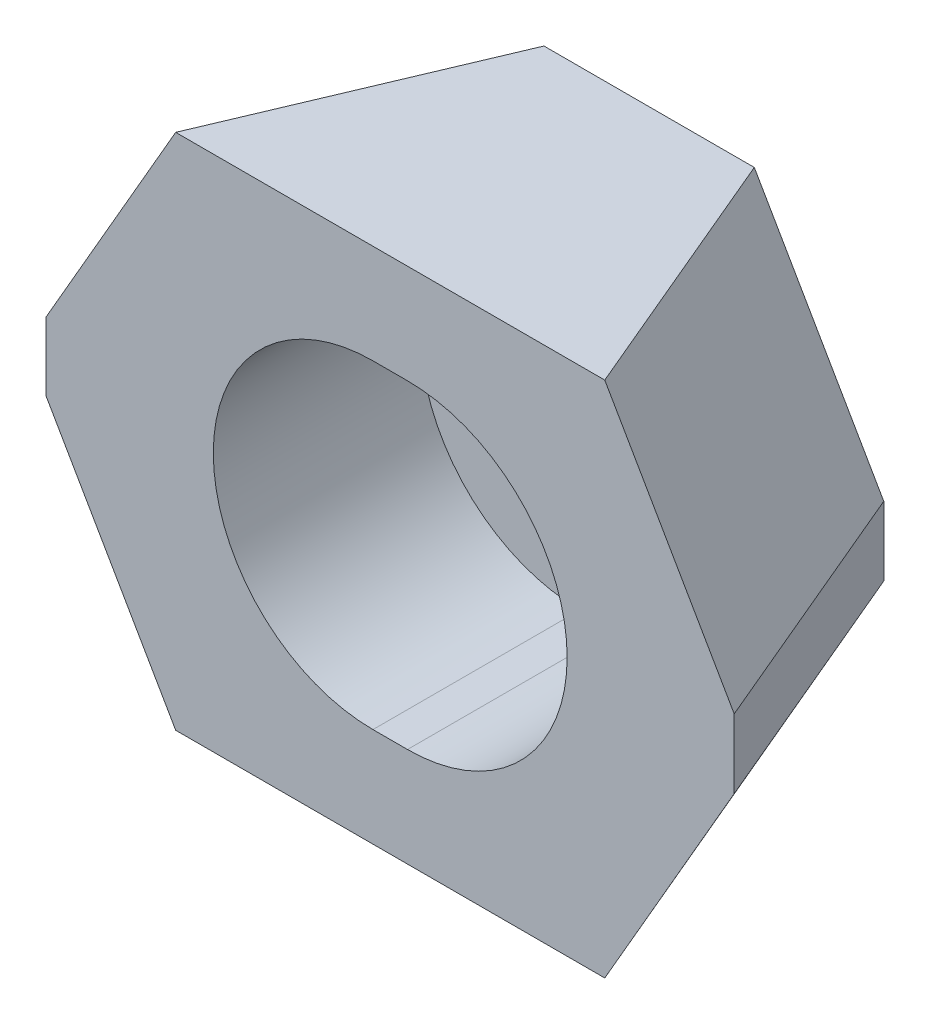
ISO-10303-21;
HEADER;
FILE_DESCRIPTION(('STEP AP214'),'2;1');
FILE_NAME('part.step','',(''),(''),'','','');
FILE_SCHEMA(('AUTOMOTIVE_DESIGN { 1 0 10303 214 1 1 1 1 }'));
ENDSEC;
DATA;
#1=APPLICATION_CONTEXT('core data for automotive mechanical design processes');
#2=APPLICATION_PROTOCOL_DEFINITION('international standard','automotive_design',2000,#1);
#3=PRODUCT_CONTEXT('',#1,'mechanical');
#4=PRODUCT('Part','Part','',(#3));
#5=PRODUCT_RELATED_PRODUCT_CATEGORY('part','',(#4));
#6=PRODUCT_DEFINITION_FORMATION('','',#4);
#7=PRODUCT_DEFINITION_CONTEXT('part definition',#1,'design');
#8=PRODUCT_DEFINITION('design','',#6,#7);
#9=PRODUCT_DEFINITION_SHAPE('','',#8);
#10=(LENGTH_UNIT() NAMED_UNIT(*) SI_UNIT(.MILLI.,.METRE.));
#11=(NAMED_UNIT(*) PLANE_ANGLE_UNIT() SI_UNIT($,.RADIAN.));
#12=(NAMED_UNIT(*) SI_UNIT($,.STERADIAN.) SOLID_ANGLE_UNIT());
#13=UNCERTAINTY_MEASURE_WITH_UNIT(LENGTH_MEASURE(1.E-05),#10,'distance_accuracy_value','');
#14=(GEOMETRIC_REPRESENTATION_CONTEXT(3) GLOBAL_UNCERTAINTY_ASSIGNED_CONTEXT((#13)) GLOBAL_UNIT_ASSIGNED_CONTEXT((#10,
#11,#12)) REPRESENTATION_CONTEXT('',''));
#15=CARTESIAN_POINT('',(0.,0.,0.));
#16=DIRECTION('',(0.,0.,1.));
#17=DIRECTION('',(1.,0.,0.));
#18=AXIS2_PLACEMENT_3D('',#15,#16,#17);
#19=CARTESIAN_POINT('',(4.79802228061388,15.,0.));
#20=DIRECTION('',(0.,1.,0.));
#21=DIRECTION('',(0.,0.,1.));
#22=AXIS2_PLACEMENT_3D('',#19,#20,#21);
#23=PLANE('',#22);
#24=DIRECTION('',(1.,0.,0.));
#25=VECTOR('',#24,1.);
#26=CARTESIAN_POINT('',(4.79802228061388,15.,0.));
#27=LINE('',#26,#25);
#28=CARTESIAN_POINT('',(6.09275533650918,15.,0.));
#29=VERTEX_POINT('',#28);
#30=CARTESIAN_POINT('',(-6.09275533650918,15.,0.));
#31=VERTEX_POINT('',#30);
#32=EDGE_CURVE('E242',#29,#31,#27,.F.);
#33=ORIENTED_EDGE('',*,*,#32,.T.);
#34=DIRECTION('',(-0.389123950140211,0.,0.921185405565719));
#35=VECTOR('',#34,1.);
#36=CARTESIAN_POINT('',(-4.4437015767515,15.,-3.90385699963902));
#37=LINE('',#36,#35);
#38=CARTESIAN_POINT('',(-12.4290034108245,15.,15.));
#39=VERTEX_POINT('',#38);
#40=EDGE_CURVE('E206',#31,#39,#37,.T.);
#41=ORIENTED_EDGE('',*,*,#40,.T.);
#42=DIRECTION('',(1.,0.,0.));
#43=VECTOR('',#42,1.);
#44=CARTESIAN_POINT('',(-28.7280533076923,15.,15.));
#45=LINE('',#44,#43);
#46=CARTESIAN_POINT('',(12.4290034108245,15.,15.));
#47=VERTEX_POINT('',#46);
#48=EDGE_CURVE('E248',#47,#39,#45,.F.);
#49=ORIENTED_EDGE('',*,*,#48,.F.);
#50=DIRECTION('',(-0.389123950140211,0.,-0.921185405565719));
#51=VECTOR('',#50,1.);
#52=CARTESIAN_POINT('',(5.89671016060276,15.,-0.464103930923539));
#53=LINE('',#52,#51);
#54=EDGE_CURVE('E236',#47,#29,#53,.T.);
#55=ORIENTED_EDGE('',*,*,#54,.T.);
#56=EDGE_LOOP('',(#33,#41,#49,#55));
#57=FACE_BOUND('',#56,.T.);
#58=ADVANCED_FACE('F14',(#57),#23,.T.);
#59=CARTESIAN_POINT('',(-4.79802228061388,-15.,0.));
#60=DIRECTION('',(0.,-1.,0.));
#61=DIRECTION('',(0.,0.,-1.));
#62=AXIS2_PLACEMENT_3D('',#59,#60,#61);
#63=PLANE('',#62);
#64=DIRECTION('',(1.,0.,0.));
#65=VECTOR('',#64,1.);
#66=CARTESIAN_POINT('',(-28.7280533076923,-15.,15.));
#67=LINE('',#66,#65);
#68=CARTESIAN_POINT('',(-12.4290034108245,-15.,15.));
#69=VERTEX_POINT('',#68);
#70=CARTESIAN_POINT('',(12.4290034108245,-15.,15.));
#71=VERTEX_POINT('',#70);
#72=EDGE_CURVE('E252',#69,#71,#67,.T.);
#73=ORIENTED_EDGE('',*,*,#72,.F.);
#74=DIRECTION('',(0.389123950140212,0.,-0.921185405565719));
#75=VECTOR('',#74,1.);
#76=CARTESIAN_POINT('',(-5.89671016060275,-15.,-0.464103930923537));
#77=LINE('',#76,#75);
#78=CARTESIAN_POINT('',(-6.09275533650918,-15.,0.));
#79=VERTEX_POINT('',#78);
#80=EDGE_CURVE('E212',#69,#79,#77,.T.);
#81=ORIENTED_EDGE('',*,*,#80,.T.);
#82=DIRECTION('',(1.,0.,0.));
#83=VECTOR('',#82,1.);
#84=CARTESIAN_POINT('',(-4.79802228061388,-15.,0.));
#85=LINE('',#84,#83);
#86=CARTESIAN_POINT('',(6.09275533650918,-15.,0.));
#87=VERTEX_POINT('',#86);
#88=EDGE_CURVE('E18',#79,#87,#85,.T.);
#89=ORIENTED_EDGE('',*,*,#88,.T.);
#90=DIRECTION('',(0.389123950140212,0.,0.921185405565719));
#91=VECTOR('',#90,1.);
#92=CARTESIAN_POINT('',(4.4437015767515,-15.,-3.90385699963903));
#93=LINE('',#92,#91);
#94=EDGE_CURVE('E225',#87,#71,#93,.T.);
#95=ORIENTED_EDGE('',*,*,#94,.T.);
#96=EDGE_LOOP('',(#73,#81,#89,#95));
#97=FACE_BOUND('',#96,.T.);
#98=ADVANCED_FACE('F284',(#97),#63,.T.);
#99=CARTESIAN_POINT('',(12.2980222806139,15.,0.));
#100=DIRECTION('',(0.,0.,-1.));
#101=DIRECTION('',(-1.,0.,0.));
#102=AXIS2_PLACEMENT_3D('',#99,#100,#101);
#103=PLANE('',#102);
#104=CARTESIAN_POINT('',(1.,0.,0.));
#105=DIRECTION('',(0.,0.,1.));
#106=DIRECTION('',(1.,0.,0.));
#107=AXIS2_PLACEMENT_3D('',#104,#105,#106);
#108=CIRCLE('',#107,6.25);
#109=CARTESIAN_POINT('',(1.,-6.25,0.));
#110=VERTEX_POINT('',#109);
#111=CARTESIAN_POINT('',(1.,6.25,0.));
#112=VERTEX_POINT('',#111);
#113=EDGE_CURVE('E131',#110,#112,#108,.T.);
#114=ORIENTED_EDGE('',*,*,#113,.T.);
#115=DIRECTION('',(-1.,0.,0.));
#116=VECTOR('',#115,1.);
#117=CARTESIAN_POINT('',(-1.,6.25,0.));
#118=LINE('',#117,#116);
#119=CARTESIAN_POINT('',(-1.,6.25,0.));
#120=VERTEX_POINT('',#119);
#121=EDGE_CURVE('E140',#112,#120,#118,.T.);
#122=ORIENTED_EDGE('',*,*,#121,.T.);
#123=CARTESIAN_POINT('',(-1.,0.,0.));
#124=DIRECTION('',(0.,0.,1.));
#125=DIRECTION('',(1.,0.,0.));
#126=AXIS2_PLACEMENT_3D('',#123,#124,#125);
#127=CIRCLE('',#126,6.25);
#128=CARTESIAN_POINT('',(-1.,-6.25,0.));
#129=VERTEX_POINT('',#128);
#130=EDGE_CURVE('E31',#120,#129,#127,.T.);
#131=ORIENTED_EDGE('',*,*,#130,.T.);
#132=DIRECTION('',(1.,0.,0.));
#133=VECTOR('',#132,1.);
#134=CARTESIAN_POINT('',(-1.,-6.25,0.));
#135=LINE('',#134,#133);
#136=EDGE_CURVE('E137',#129,#110,#135,.T.);
#137=ORIENTED_EDGE('',*,*,#136,.T.);
#138=EDGE_LOOP('',(#114,#122,#131,#137));
#139=FACE_BOUND('',#138,.T.);
#140=ORIENTED_EDGE('',*,*,#88,.F.);
#141=DIRECTION('',(-0.499722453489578,0.8661855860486,0.));
#142=VECTOR('',#141,1.);
#143=CARTESIAN_POINT('',(-14.4857353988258,-0.452167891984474,0.));
#144=LINE('',#143,#142);
#145=CARTESIAN_POINT('',(-13.5927553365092,-2.,0.));
#146=VERTEX_POINT('',#145);
#147=EDGE_CURVE('E215',#79,#146,#144,.T.);
#148=ORIENTED_EDGE('',*,*,#147,.T.);
#149=DIRECTION('',(0.,1.,0.));
#150=VECTOR('',#149,1.);
#151=CARTESIAN_POINT('',(-13.5927553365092,15.,0.));
#152=LINE('',#151,#150);
#153=CARTESIAN_POINT('',(-13.5927553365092,2.,0.));
#154=VERTEX_POINT('',#153);
#155=EDGE_CURVE('E209',#146,#154,#152,.T.);
#156=ORIENTED_EDGE('',*,*,#155,.T.);
#157=DIRECTION('',(0.499722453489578,0.8661855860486,0.));
#158=VECTOR('',#157,1.);
#159=CARTESIAN_POINT('',(-1.50016381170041,22.9604919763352,0.));
#160=LINE('',#159,#158);
#161=EDGE_CURVE('E207',#154,#31,#160,.T.);
#162=ORIENTED_EDGE('',*,*,#161,.T.);
#163=ORIENTED_EDGE('',*,*,#32,.F.);
#164=DIRECTION('',(0.499722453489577,-0.8661855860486,0.));
#165=VECTOR('',#164,1.);
#166=CARTESIAN_POINT('',(7.64235030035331,12.3140353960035,0.));
#167=LINE('',#166,#165);
#168=CARTESIAN_POINT('',(13.5927553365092,2.,0.));
#169=VERTEX_POINT('',#168);
#170=EDGE_CURVE('E239',#29,#169,#167,.T.);
#171=ORIENTED_EDGE('',*,*,#170,.T.);
#172=DIRECTION('',(0.,-1.,0.));
#173=VECTOR('',#172,1.);
#174=CARTESIAN_POINT('',(13.5927553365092,15.,0.));
#175=LINE('',#174,#173);
#176=CARTESIAN_POINT('',(13.5927553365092,-2.,0.));
#177=VERTEX_POINT('',#176);
#178=EDGE_CURVE('E231',#169,#177,#175,.T.);
#179=ORIENTED_EDGE('',*,*,#178,.T.);
#180=DIRECTION('',(-0.499722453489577,-0.8661855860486,0.));
#181=VECTOR('',#180,1.);
#182=CARTESIAN_POINT('',(20.6279218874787,10.1942886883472,0.));
#183=LINE('',#182,#181);
#184=EDGE_CURVE('E228',#177,#87,#183,.T.);
#185=ORIENTED_EDGE('',*,*,#184,.T.);
#186=EDGE_LOOP('',(#140,#148,#156,#162,#163,#171,#179,#185));
#187=FACE_BOUND('',#186,.T.);
#188=ADVANCED_FACE('F16',(#139,#187),#103,.T.);
#189=CARTESIAN_POINT('',(-28.7280533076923,15.,15.));
#190=DIRECTION('',(0.,0.,1.));
#191=DIRECTION('',(1.,0.,0.));
#192=AXIS2_PLACEMENT_3D('',#189,#190,#191);
#193=PLANE('',#192);
#194=CARTESIAN_POINT('',(-1.,0.,15.));
#195=DIRECTION('',(0.,0.,1.));
#196=DIRECTION('',(1.,0.,0.));
#197=AXIS2_PLACEMENT_3D('',#194,#195,#196);
#198=CIRCLE('',#197,9.25);
#199=CARTESIAN_POINT('',(-1.,9.25,15.));
#200=VERTEX_POINT('',#199);
#201=CARTESIAN_POINT('',(-1.,-9.25,15.));
#202=VERTEX_POINT('',#201);
#203=EDGE_CURVE('E161',#200,#202,#198,.T.);
#204=ORIENTED_EDGE('',*,*,#203,.F.);
#205=DIRECTION('',(-1.,0.,0.));
#206=VECTOR('',#205,1.);
#207=CARTESIAN_POINT('',(-1.,9.25,15.));
#208=LINE('',#207,#206);
#209=CARTESIAN_POINT('',(1.,9.25,15.));
#210=VERTEX_POINT('',#209);
#211=EDGE_CURVE('E169',#210,#200,#208,.T.);
#212=ORIENTED_EDGE('',*,*,#211,.F.);
#213=CARTESIAN_POINT('',(1.,0.,15.));
#214=DIRECTION('',(0.,0.,1.));
#215=DIRECTION('',(1.,0.,0.));
#216=AXIS2_PLACEMENT_3D('',#213,#214,#215);
#217=CIRCLE('',#216,9.25);
#218=CARTESIAN_POINT('',(1.,-9.25,15.));
#219=VERTEX_POINT('',#218);
#220=EDGE_CURVE('E183',#219,#210,#217,.T.);
#221=ORIENTED_EDGE('',*,*,#220,.F.);
#222=DIRECTION('',(1.,0.,0.));
#223=VECTOR('',#222,1.);
#224=CARTESIAN_POINT('',(-1.,-9.25,15.));
#225=LINE('',#224,#223);
#226=EDGE_CURVE('E180',#202,#219,#225,.T.);
#227=ORIENTED_EDGE('',*,*,#226,.F.);
#228=EDGE_LOOP('',(#204,#212,#221,#227));
#229=FACE_BOUND('',#228,.T.);
#230=DIRECTION('',(0.,-1.,0.));
#231=VECTOR('',#230,1.);
#232=CARTESIAN_POINT('',(-19.9290034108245,15.,15.));
#233=LINE('',#232,#231);
#234=CARTESIAN_POINT('',(-19.9290034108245,2.,15.));
#235=VERTEX_POINT('',#234);
#236=CARTESIAN_POINT('',(-19.9290034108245,-2.,15.));
#237=VERTEX_POINT('',#236);
#238=EDGE_CURVE('E24',#235,#237,#233,.T.);
#239=ORIENTED_EDGE('',*,*,#238,.T.);
#240=DIRECTION('',(0.499722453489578,-0.8661855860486,0.));
#241=VECTOR('',#240,1.);
#242=CARTESIAN_POINT('',(-29.4848149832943,14.5634067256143,15.));
#243=LINE('',#242,#241);
#244=EDGE_CURVE('E9',#237,#69,#243,.T.);
#245=ORIENTED_EDGE('',*,*,#244,.T.);
#246=ORIENTED_EDGE('',*,*,#72,.T.);
#247=DIRECTION('',(0.499722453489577,0.8661855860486,0.));
#248=VECTOR('',#247,1.);
#249=CARTESIAN_POINT('',(15.1367306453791,-10.306606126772,15.));
#250=LINE('',#249,#248);
#251=CARTESIAN_POINT('',(19.9290034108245,-2.,15.));
#252=VERTEX_POINT('',#251);
#253=EDGE_CURVE('E251',#71,#252,#250,.T.);
#254=ORIENTED_EDGE('',*,*,#253,.T.);
#255=DIRECTION('',(0.,1.,0.));
#256=VECTOR('',#255,1.);
#257=CARTESIAN_POINT('',(19.9290034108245,15.,15.));
#258=LINE('',#257,#256);
#259=CARTESIAN_POINT('',(19.9290034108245,2.,15.));
#260=VERTEX_POINT('',#259);
#261=EDGE_CURVE('E256',#252,#260,#258,.T.);
#262=ORIENTED_EDGE('',*,*,#261,.T.);
#263=DIRECTION('',(-0.499722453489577,0.8661855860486,0.));
#264=VECTOR('',#263,1.);
#265=CARTESIAN_POINT('',(2.15115905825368,32.8149302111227,15.));
#266=LINE('',#265,#264);
#267=EDGE_CURVE('E259',#260,#47,#266,.T.);
#268=ORIENTED_EDGE('',*,*,#267,.T.);
#269=ORIENTED_EDGE('',*,*,#48,.T.);
#270=DIRECTION('',(-0.499722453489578,-0.8661855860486,0.));
#271=VECTOR('',#270,1.);
#272=CARTESIAN_POINT('',(-16.4992433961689,7.94491735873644,15.));
#273=LINE('',#272,#271);
#274=EDGE_CURVE('E262',#39,#235,#273,.T.);
#275=ORIENTED_EDGE('',*,*,#274,.T.);
#276=EDGE_LOOP('',(#239,#245,#246,#254,#262,#268,#269,#275));
#277=FACE_BOUND('',#276,.T.);
#278=ADVANCED_FACE('F272',(#229,#277),#193,.T.);
#279=CARTESIAN_POINT('',(17.8169207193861,2.,10.));
#280=DIRECTION('',(0.813444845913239,0.469295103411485,-0.343612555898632));
#281=DIRECTION('',(-0.499722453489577,0.8661855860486,0.));
#282=AXIS2_PLACEMENT_3D('',#279,#280,#281);
#283=PLANE('',#282);
#284=ORIENTED_EDGE('',*,*,#170,.F.);
#285=ORIENTED_EDGE('',*,*,#54,.F.);
#286=ORIENTED_EDGE('',*,*,#267,.F.);
#287=DIRECTION('',(0.389123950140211,0.,0.921185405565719));
#288=VECTOR('',#287,1.);
#289=CARTESIAN_POINT('',(8.69984639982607,2.,-11.5831377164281));
#290=LINE('',#289,#288);
#291=EDGE_CURVE('E224',#169,#260,#290,.T.);
#292=ORIENTED_EDGE('',*,*,#291,.F.);
#293=EDGE_LOOP('',(#284,#285,#286,#292));
#294=FACE_BOUND('',#293,.T.);
#295=ADVANCED_FACE('F295',(#294),#283,.T.);
#296=CARTESIAN_POINT('',(17.8169207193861,0.,10.));
#297=DIRECTION('',(0.921185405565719,0.,-0.389123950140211));
#298=DIRECTION('',(-0.389123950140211,0.,-0.92118540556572));
#299=AXIS2_PLACEMENT_3D('',#296,#297,#298);
#300=PLANE('',#299);
#301=ORIENTED_EDGE('',*,*,#178,.F.);
#302=ORIENTED_EDGE('',*,*,#291,.T.);
#303=ORIENTED_EDGE('',*,*,#261,.F.);
#304=DIRECTION('',(0.389123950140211,0.,0.921185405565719));
#305=VECTOR('',#304,1.);
#306=CARTESIAN_POINT('',(8.69984639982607,-2.,-11.5831377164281));
#307=LINE('',#306,#305);
#308=EDGE_CURVE('E218',#177,#252,#307,.T.);
#309=ORIENTED_EDGE('',*,*,#308,.F.);
#310=EDGE_LOOP('',(#301,#302,#303,#309));
#311=FACE_BOUND('',#310,.T.);
#312=ADVANCED_FACE('F292',(#311),#300,.T.);
#313=CARTESIAN_POINT('',(17.8169207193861,-2.,10.));
#314=DIRECTION('',(0.813444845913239,-0.469295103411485,-0.343612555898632));
#315=DIRECTION('',(-0.499722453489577,-0.8661855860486,0.));
#316=AXIS2_PLACEMENT_3D('',#313,#314,#315);
#317=PLANE('',#316);
#318=ORIENTED_EDGE('',*,*,#184,.F.);
#319=ORIENTED_EDGE('',*,*,#308,.T.);
#320=ORIENTED_EDGE('',*,*,#253,.F.);
#321=ORIENTED_EDGE('',*,*,#94,.F.);
#322=EDGE_LOOP('',(#318,#319,#320,#321));
#323=FACE_BOUND('',#322,.T.);
#324=ADVANCED_FACE('F287',(#323),#317,.T.);
#325=CARTESIAN_POINT('',(-17.8169207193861,-2.,10.));
#326=DIRECTION('',(-0.813444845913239,-0.469295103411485,-0.343612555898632));
#327=DIRECTION('',(0.499722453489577,-0.866185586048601,0.));
#328=AXIS2_PLACEMENT_3D('',#325,#326,#327);
#329=PLANE('',#328);
#330=ORIENTED_EDGE('',*,*,#147,.F.);
#331=ORIENTED_EDGE('',*,*,#80,.F.);
#332=ORIENTED_EDGE('',*,*,#244,.F.);
#333=DIRECTION('',(-0.389123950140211,0.,0.92118540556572));
#334=VECTOR('',#333,1.);
#335=CARTESIAN_POINT('',(-8.69984639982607,-2.,-11.5831377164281));
#336=LINE('',#335,#334);
#337=EDGE_CURVE('E202',#146,#237,#336,.T.);
#338=ORIENTED_EDGE('',*,*,#337,.F.);
#339=EDGE_LOOP('',(#330,#331,#332,#338));
#340=FACE_BOUND('',#339,.T.);
#341=ADVANCED_FACE('F279',(#340),#329,.T.);
#342=CARTESIAN_POINT('',(-17.8169207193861,0.,10.));
#343=DIRECTION('',(-0.921185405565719,0.,-0.389123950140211));
#344=DIRECTION('',(0.389123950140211,0.,-0.92118540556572));
#345=AXIS2_PLACEMENT_3D('',#342,#343,#344);
#346=PLANE('',#345);
#347=ORIENTED_EDGE('',*,*,#155,.F.);
#348=ORIENTED_EDGE('',*,*,#337,.T.);
#349=ORIENTED_EDGE('',*,*,#238,.F.);
#350=DIRECTION('',(-0.389123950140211,0.,0.92118540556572));
#351=VECTOR('',#350,1.);
#352=CARTESIAN_POINT('',(-8.69984639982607,2.,-11.5831377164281));
#353=LINE('',#352,#351);
#354=EDGE_CURVE('E190',#154,#235,#353,.T.);
#355=ORIENTED_EDGE('',*,*,#354,.F.);
#356=EDGE_LOOP('',(#347,#348,#349,#355));
#357=FACE_BOUND('',#356,.T.);
#358=ADVANCED_FACE('F276',(#357),#346,.T.);
#359=CARTESIAN_POINT('',(-17.8169207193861,2.,10.));
#360=DIRECTION('',(-0.813444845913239,0.469295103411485,-0.343612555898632));
#361=DIRECTION('',(0.499722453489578,0.866185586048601,0.));
#362=AXIS2_PLACEMENT_3D('',#359,#360,#361);
#363=PLANE('',#362);
#364=ORIENTED_EDGE('',*,*,#161,.F.);
#365=ORIENTED_EDGE('',*,*,#354,.T.);
#366=ORIENTED_EDGE('',*,*,#274,.F.);
#367=ORIENTED_EDGE('',*,*,#40,.F.);
#368=EDGE_LOOP('',(#364,#365,#366,#367));
#369=FACE_BOUND('',#368,.T.);
#370=ADVANCED_FACE('F300',(#369),#363,.T.);
#371=CARTESIAN_POINT('',(-1.,0.,3.));
#372=DIRECTION('',(0.,0.,1.));
#373=DIRECTION('',(1.,0.,0.));
#374=AXIS2_PLACEMENT_3D('',#371,#372,#373);
#375=CYLINDRICAL_SURFACE('',#374,9.25);
#376=ORIENTED_EDGE('',*,*,#203,.T.);
#377=DIRECTION('',(0.,0.,1.));
#378=VECTOR('',#377,1.);
#379=CARTESIAN_POINT('',(-1.,-9.25,3.));
#380=LINE('',#379,#378);
#381=CARTESIAN_POINT('',(-1.,-9.25,3.));
#382=VERTEX_POINT('',#381);
#383=EDGE_CURVE('E178',#382,#202,#380,.T.);
#384=ORIENTED_EDGE('',*,*,#383,.F.);
#385=CARTESIAN_POINT('',(-1.,0.,3.));
#386=DIRECTION('',(0.,0.,1.));
#387=DIRECTION('',(1.,0.,0.));
#388=AXIS2_PLACEMENT_3D('',#385,#386,#387);
#389=CIRCLE('',#388,9.25);
#390=CARTESIAN_POINT('',(-1.,9.25,3.));
#391=VERTEX_POINT('',#390);
#392=EDGE_CURVE('E165',#391,#382,#389,.T.);
#393=ORIENTED_EDGE('',*,*,#392,.F.);
#394=DIRECTION('',(0.,0.,1.));
#395=VECTOR('',#394,1.);
#396=CARTESIAN_POINT('',(-1.,9.25,3.));
#397=LINE('',#396,#395);
#398=EDGE_CURVE('E188',#391,#200,#397,.T.);
#399=ORIENTED_EDGE('',*,*,#398,.T.);
#400=EDGE_LOOP('',(#376,#384,#393,#399));
#401=FACE_BOUND('',#400,.T.);
#402=ADVANCED_FACE('F302',(#401),#375,.F.);
#403=CARTESIAN_POINT('',(-1.,9.25,3.));
#404=DIRECTION('',(0.,1.,0.));
#405=DIRECTION('',(-1.,0.,0.));
#406=AXIS2_PLACEMENT_3D('',#403,#404,#405);
#407=PLANE('',#406);
#408=ORIENTED_EDGE('',*,*,#211,.T.);
#409=ORIENTED_EDGE('',*,*,#398,.F.);
#410=DIRECTION('',(-1.,0.,0.));
#411=VECTOR('',#410,1.);
#412=CARTESIAN_POINT('',(-1.,9.25,3.));
#413=LINE('',#412,#411);
#414=CARTESIAN_POINT('',(1.,9.25,3.));
#415=VERTEX_POINT('',#414);
#416=EDGE_CURVE('E175',#415,#391,#413,.T.);
#417=ORIENTED_EDGE('',*,*,#416,.F.);
#418=DIRECTION('',(0.,0.,1.));
#419=VECTOR('',#418,1.);
#420=CARTESIAN_POINT('',(1.,9.25,3.));
#421=LINE('',#420,#419);
#422=EDGE_CURVE('E191',#415,#210,#421,.T.);
#423=ORIENTED_EDGE('',*,*,#422,.T.);
#424=EDGE_LOOP('',(#408,#409,#417,#423));
#425=FACE_BOUND('',#424,.T.);
#426=ADVANCED_FACE('F310',(#425),#407,.F.);
#427=CARTESIAN_POINT('',(1.,0.,3.));
#428=DIRECTION('',(0.,0.,1.));
#429=DIRECTION('',(1.,0.,0.));
#430=AXIS2_PLACEMENT_3D('',#427,#428,#429);
#431=CYLINDRICAL_SURFACE('',#430,9.25);
#432=ORIENTED_EDGE('',*,*,#220,.T.);
#433=ORIENTED_EDGE('',*,*,#422,.F.);
#434=CARTESIAN_POINT('',(1.,0.,3.));
#435=DIRECTION('',(0.,0.,1.));
#436=DIRECTION('',(1.,0.,0.));
#437=AXIS2_PLACEMENT_3D('',#434,#435,#436);
#438=CIRCLE('',#437,9.25);
#439=CARTESIAN_POINT('',(1.,-9.25,3.));
#440=VERTEX_POINT('',#439);
#441=EDGE_CURVE('E172',#440,#415,#438,.T.);
#442=ORIENTED_EDGE('',*,*,#441,.F.);
#443=DIRECTION('',(0.,0.,1.));
#444=VECTOR('',#443,1.);
#445=CARTESIAN_POINT('',(1.,-9.25,3.));
#446=LINE('',#445,#444);
#447=EDGE_CURVE('E193',#440,#219,#446,.T.);
#448=ORIENTED_EDGE('',*,*,#447,.T.);
#449=EDGE_LOOP('',(#432,#433,#442,#448));
#450=FACE_BOUND('',#449,.T.);
#451=ADVANCED_FACE('F342',(#450),#431,.F.);
#452=CARTESIAN_POINT('',(-1.,-9.25,3.));
#453=DIRECTION('',(0.,-1.,0.));
#454=DIRECTION('',(0.,0.,-1.));
#455=AXIS2_PLACEMENT_3D('',#452,#453,#454);
#456=PLANE('',#455);
#457=ORIENTED_EDGE('',*,*,#226,.T.);
#458=ORIENTED_EDGE('',*,*,#447,.F.);
#459=DIRECTION('',(1.,0.,0.));
#460=VECTOR('',#459,1.);
#461=CARTESIAN_POINT('',(-1.,-9.25,3.));
#462=LINE('',#461,#460);
#463=EDGE_CURVE('E168',#382,#440,#462,.T.);
#464=ORIENTED_EDGE('',*,*,#463,.F.);
#465=ORIENTED_EDGE('',*,*,#383,.T.);
#466=EDGE_LOOP('',(#457,#458,#464,#465));
#467=FACE_BOUND('',#466,.T.);
#468=ADVANCED_FACE('F338',(#467),#456,.F.);
#469=CARTESIAN_POINT('',(-1.,0.,3.));
#470=DIRECTION('',(0.,0.,1.));
#471=DIRECTION('',(1.,0.,0.));
#472=AXIS2_PLACEMENT_3D('',#469,#470,#471);
#473=PLANE('',#472);
#474=CARTESIAN_POINT('',(1.,0.,3.));
#475=DIRECTION('',(0.,0.,1.));
#476=DIRECTION('',(1.,0.,0.));
#477=AXIS2_PLACEMENT_3D('',#474,#475,#476);
#478=CIRCLE('',#477,6.25);
#479=CARTESIAN_POINT('',(1.,-6.25,3.));
#480=VERTEX_POINT('',#479);
#481=CARTESIAN_POINT('',(1.,6.25,3.));
#482=VERTEX_POINT('',#481);
#483=EDGE_CURVE('E39',#480,#482,#478,.T.);
#484=ORIENTED_EDGE('',*,*,#483,.F.);
#485=DIRECTION('',(1.,0.,0.));
#486=VECTOR('',#485,1.);
#487=CARTESIAN_POINT('',(-1.,-6.25,3.));
#488=LINE('',#487,#486);
#489=CARTESIAN_POINT('',(-1.,-6.25,3.));
#490=VERTEX_POINT('',#489);
#491=EDGE_CURVE('E146',#490,#480,#488,.T.);
#492=ORIENTED_EDGE('',*,*,#491,.F.);
#493=CARTESIAN_POINT('',(-1.,0.,3.));
#494=DIRECTION('',(0.,0.,1.));
#495=DIRECTION('',(1.,0.,0.));
#496=AXIS2_PLACEMENT_3D('',#493,#494,#495);
#497=CIRCLE('',#496,6.25);
#498=CARTESIAN_POINT('',(-1.,6.25,3.));
#499=VERTEX_POINT('',#498);
#500=EDGE_CURVE('E149',#499,#490,#497,.T.);
#501=ORIENTED_EDGE('',*,*,#500,.F.);
#502=DIRECTION('',(-1.,0.,0.));
#503=VECTOR('',#502,1.);
#504=CARTESIAN_POINT('',(-1.,6.25,3.));
#505=LINE('',#504,#503);
#506=EDGE_CURVE('E155',#482,#499,#505,.T.);
#507=ORIENTED_EDGE('',*,*,#506,.F.);
#508=EDGE_LOOP('',(#484,#492,#501,#507));
#509=FACE_BOUND('',#508,.T.);
#510=ORIENTED_EDGE('',*,*,#392,.T.);
#511=ORIENTED_EDGE('',*,*,#463,.T.);
#512=ORIENTED_EDGE('',*,*,#441,.T.);
#513=ORIENTED_EDGE('',*,*,#416,.T.);
#514=EDGE_LOOP('',(#510,#511,#512,#513));
#515=FACE_BOUND('',#514,.T.);
#516=ADVANCED_FACE('F341',(#509,#515),#473,.T.);
#517=CARTESIAN_POINT('',(1.,0.,0.));
#518=DIRECTION('',(0.,0.,1.));
#519=DIRECTION('',(1.,0.,0.));
#520=AXIS2_PLACEMENT_3D('',#517,#518,#519);
#521=CYLINDRICAL_SURFACE('',#520,6.25);
#522=ORIENTED_EDGE('',*,*,#483,.T.);
#523=DIRECTION('',(0.,0.,1.));
#524=VECTOR('',#523,1.);
#525=CARTESIAN_POINT('',(1.,6.25,0.));
#526=LINE('',#525,#524);
#527=EDGE_CURVE('E127',#112,#482,#526,.T.);
#528=ORIENTED_EDGE('',*,*,#527,.F.);
#529=ORIENTED_EDGE('',*,*,#113,.F.);
#530=DIRECTION('',(0.,0.,1.));
#531=VECTOR('',#530,1.);
#532=CARTESIAN_POINT('',(1.,-6.25,0.));
#533=LINE('',#532,#531);
#534=EDGE_CURVE('E159',#110,#480,#533,.T.);
#535=ORIENTED_EDGE('',*,*,#534,.T.);
#536=EDGE_LOOP('',(#522,#528,#529,#535));
#537=FACE_BOUND('',#536,.T.);
#538=ADVANCED_FACE('F129',(#537),#521,.F.);
#539=CARTESIAN_POINT('',(-1.,-6.25,0.));
#540=DIRECTION('',(0.,-1.,0.));
#541=DIRECTION('',(1.,0.,0.));
#542=AXIS2_PLACEMENT_3D('',#539,#540,#541);
#543=PLANE('',#542);
#544=ORIENTED_EDGE('',*,*,#491,.T.);
#545=ORIENTED_EDGE('',*,*,#534,.F.);
#546=ORIENTED_EDGE('',*,*,#136,.F.);
#547=DIRECTION('',(0.,0.,1.));
#548=VECTOR('',#547,1.);
#549=CARTESIAN_POINT('',(-1.,-6.25,0.));
#550=LINE('',#549,#548);
#551=EDGE_CURVE('E162',#129,#490,#550,.T.);
#552=ORIENTED_EDGE('',*,*,#551,.T.);
#553=EDGE_LOOP('',(#544,#545,#546,#552));
#554=FACE_BOUND('',#553,.T.);
#555=ADVANCED_FACE('F355',(#554),#543,.F.);
#556=CARTESIAN_POINT('',(-1.,0.,0.));
#557=DIRECTION('',(0.,0.,1.));
#558=DIRECTION('',(1.,0.,0.));
#559=AXIS2_PLACEMENT_3D('',#556,#557,#558);
#560=CYLINDRICAL_SURFACE('',#559,6.25);
#561=ORIENTED_EDGE('',*,*,#500,.T.);
#562=ORIENTED_EDGE('',*,*,#551,.F.);
#563=ORIENTED_EDGE('',*,*,#130,.F.);
#564=DIRECTION('',(0.,0.,1.));
#565=VECTOR('',#564,1.);
#566=CARTESIAN_POINT('',(-1.,6.25,0.));
#567=LINE('',#566,#565);
#568=EDGE_CURVE('E136',#120,#499,#567,.T.);
#569=ORIENTED_EDGE('',*,*,#568,.T.);
#570=EDGE_LOOP('',(#561,#562,#563,#569));
#571=FACE_BOUND('',#570,.T.);
#572=ADVANCED_FACE('F358',(#571),#560,.F.);
#573=CARTESIAN_POINT('',(-1.,6.25,0.));
#574=DIRECTION('',(0.,1.,0.));
#575=DIRECTION('',(0.,0.,1.));
#576=AXIS2_PLACEMENT_3D('',#573,#574,#575);
#577=PLANE('',#576);
#578=ORIENTED_EDGE('',*,*,#506,.T.);
#579=ORIENTED_EDGE('',*,*,#568,.F.);
#580=ORIENTED_EDGE('',*,*,#121,.F.);
#581=ORIENTED_EDGE('',*,*,#527,.T.);
#582=EDGE_LOOP('',(#578,#579,#580,#581));
#583=FACE_BOUND('',#582,.T.);
#584=ADVANCED_FACE('F141',(#583),#577,.F.);
#585=CLOSED_SHELL('',(#58,#98,#188,#278,#295,#312,#324,#341,#358,#370,#402,#426,#451,#468,#516,
#538,#555,#572,#584));
#586=MANIFOLD_SOLID_BREP('B1',#585);
#587=ADVANCED_BREP_SHAPE_REPRESENTATION('',(#18,#586),#14);
#588=SHAPE_DEFINITION_REPRESENTATION(#9,#587);
ENDSEC;
END-ISO-10303-21;
